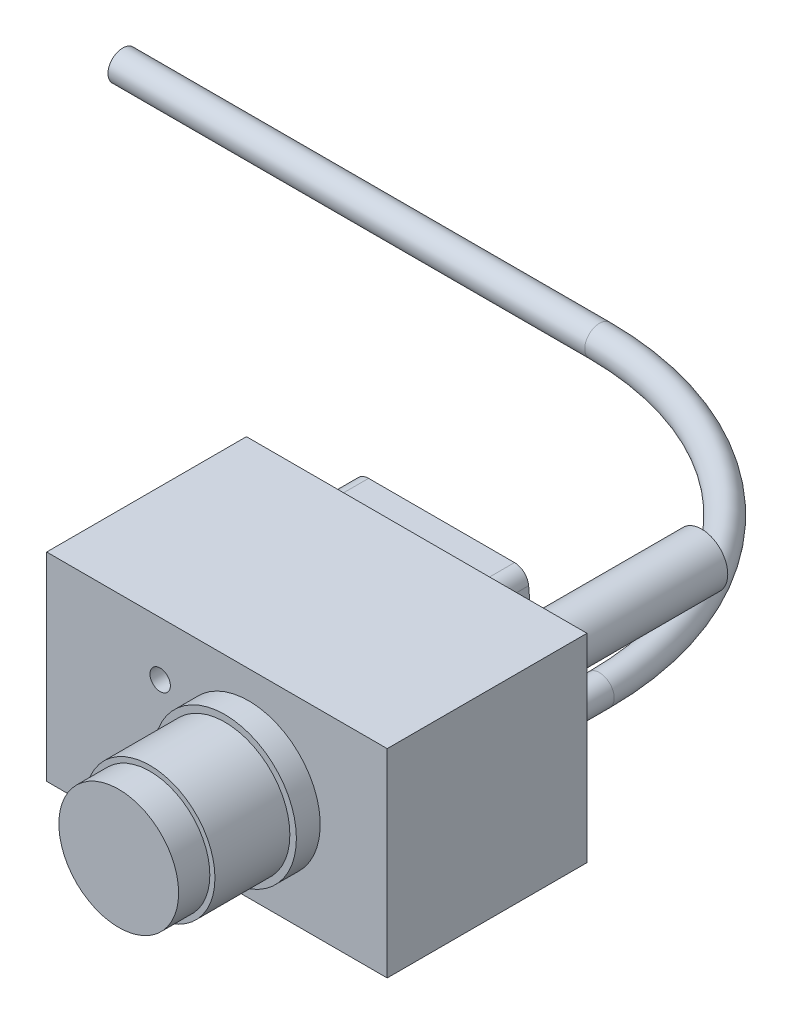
from build123d import *

# Parameters (mm, degrees)
SKETCH2_W           = 76.2
SKETCH2_H           = 44.704
BASE_EXTRUDE_DEPTH  = 22.225
SKETCH3_R           = 16.002
BOSS_EXTRUDE1_DEPTH = 5.334
SKETCH4_R           = 14.5415
BOSS_EXTRUDE2_DEPTH = 16.764
SKETCH6_R           = 13.3985
BOSS_EXTRUDE3_DEPTH = 6.985
BOSS_EXTRUDE4_DEPTH = 12.7
SKETCH15_R          = 6.35
EXTRUDE1_DEPTH      = 2.54
SKETCH8_R           = 3.302
SKETCH16_R          = 5.842
EXTRUDE2_DEPTH      = 35.56
SKETCH17_R          = 2.286
CUT_EXTRUDE1_DEPTH  = 12.7


with BuildPart() as part:
    # Sketch2 → Base-Extrude (new, symmetric)
    with BuildSketch(Plane(origin=(0, 0, 0), x_dir=(1, 0, 0), z_dir=(0, 1, 0))):
        Rectangle(SKETCH2_W, SKETCH2_H)
    extrude(amount=BASE_EXTRUDE_DEPTH, both=True)

    # Sketch3 → Boss-Extrude1 (add)
    with BuildSketch(Plane.XY.offset(22.352)):
        with Locations(Location((7.112, 0, 0), (0, 0, 180))):
            Circle(SKETCH3_R)
    extrude(amount=BOSS_EXTRUDE1_DEPTH)

    # Sketch4 → Boss-Extrude2 (add)
    with BuildSketch(Plane.XY.offset(27.686)):
        with Locations((7.112, 0)):
            Circle(SKETCH4_R)
    extrude(amount=BOSS_EXTRUDE2_DEPTH)

    # Sketch6 → Boss-Extrude3 (add)
    with BuildSketch(Plane.XY.offset(44.45)):
        with Locations((7.112, 0)):
            Circle(SKETCH6_R)
    extrude(amount=BOSS_EXTRUDE3_DEPTH)

    # Sketch7 → Boss-Extrude4 (add)
    with BuildSketch(Plane(origin=(0, 0, -22.352), x_dir=(-1, 0, 0), z_dir=(0, 0, -1))):
        with BuildLine():
            Line((-9.505308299, 5.0546), (23.792855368, 5.0546))
            ThreePointArc((23.792855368, 5.0546), (26.133710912, 6.084601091), (26.955773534, 8.506319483))
            Line((26.955773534, 8.506319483), (26.631330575, 12.214719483))
            ThreePointArc((26.631330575, 12.214719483), (25.613411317, 14.278855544), (23.468412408, 15.113))
            Line((23.468412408, 15.113), (-9.180865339, 15.113))
            ThreePointArc((-9.180865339, 15.113), (-11.325864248, 14.278855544), (-12.343783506, 12.214719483))
            Line((-12.343783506, 12.214719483), (-12.668226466, 8.506319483))
            ThreePointArc((-12.668226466, 8.506319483), (-11.846163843, 6.084601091), (-9.505308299, 5.0546))
        make_face()
    extrude(amount=BOSS_EXTRUDE4_DEPTH)

    # Sketch15 → Extrude1 (add)
    with BuildSketch(Plane(origin=(0, 0, -22.352), x_dir=(-1, 0, 0), z_dir=(0, 0, -1))):
        with Locations(Location((-28.194, 0, 0), (0, 0, 180))):
            Circle(SKETCH15_R)
    extrude(amount=EXTRUDE1_DEPTH)

    # Sweep1: sweep along a path in Sketch13
    with BuildLine(Plane(origin=(97.45548874, 0, 0), x_dir=(-1, 0, 0), z_dir=(0, 1, 0))) as sweep1_path:
        Line((69.26148874, -22.352), (69.26148874, -35.052))
        ThreePointArc((69.26148874, -35.052), (89.087723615, -82.916765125), (136.95248874, -102.743))
        Line((136.95248874, -102.743), (243.63248874, -102.743))
    # Sketch8 → Sweep1 (sweep)
    with BuildSketch(Plane(origin=(0, 0, -22.352), x_dir=(-1, 0, 0), z_dir=(0, 0, -1))):
        with Locations((-28.194, 0)):
            Circle(SKETCH8_R)
    sweep(path=sweep1_path.line)

    # Sketch16 → Extrude2 (add)
    with BuildSketch(Plane(origin=(0, 0, -22.352), x_dir=(-1, 0, 0), z_dir=(0, 0, -1))):
        with Locations(Location((-28.194, 13.843, 0), (0, 0, 180))):
            Circle(SKETCH16_R)
    extrude(amount=EXTRUDE2_DEPTH)

    # Sketch17 → Cut-Extrude1 (cut)
    with BuildSketch(Plane.XY.offset(22.352)):
        with Locations((-12.7, -10.16)):
            Circle(SKETCH17_R)
        with Locations((-12.7, 10.16)):
            Circle(SKETCH17_R)
    extrude(amount=-CUT_EXTRUDE1_DEPTH, mode=Mode.SUBTRACT)


solid = part.part
